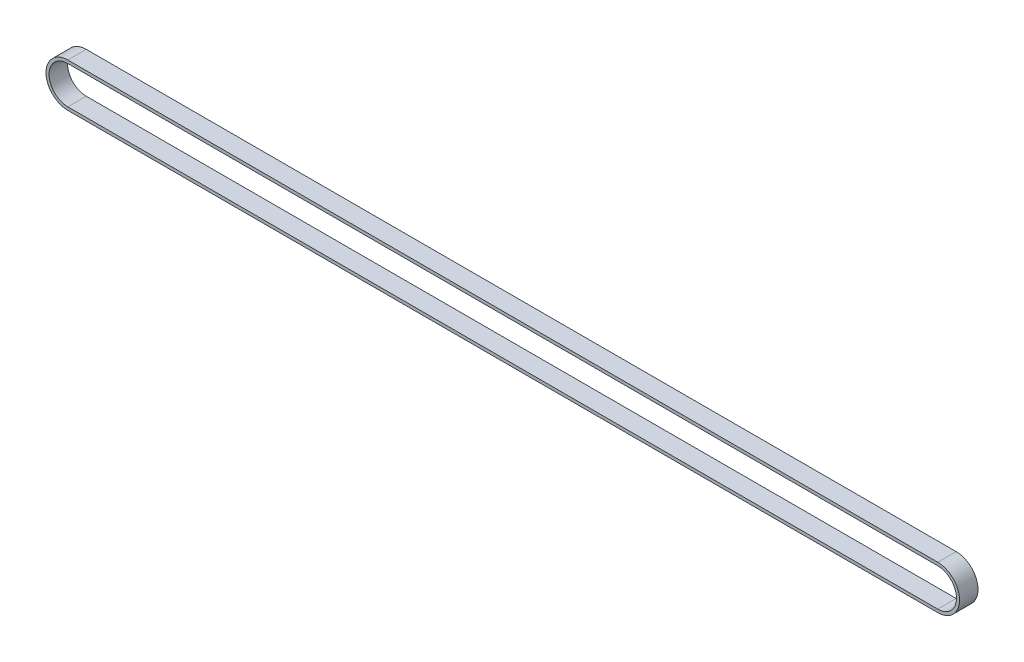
from build123d import *

# Parameters (mm, degrees)
EXTRUDE_1_DEPTH = 6


with BuildPart() as part:
    # Sketch 1 → Extrude 1 (new body)
    with BuildSketch(Plane.XY):
        with BuildLine():
            Line((0, 7.1), (283, 7.1))
            ThreePointArc((283, 7.1), (290.1, 0), (283, -7.1))
            Line((283, -7.1), (0, -7.1))
            ThreePointArc((0, -7.1), (-7.1, 0), (0, 7.1))
        make_face()
        with BuildLine():
            Line((0, 6.1), (283, 6.1))
            ThreePointArc((283, 6.1), (289.1, 0), (283, -6.1))
            Line((283, -6.1), (0, -6.1))
            ThreePointArc((0, -6.1), (-6.1, 0), (0, 6.1))
        make_face(mode=Mode.SUBTRACT)
    extrude(amount=EXTRUDE_1_DEPTH)


solid = part.part
